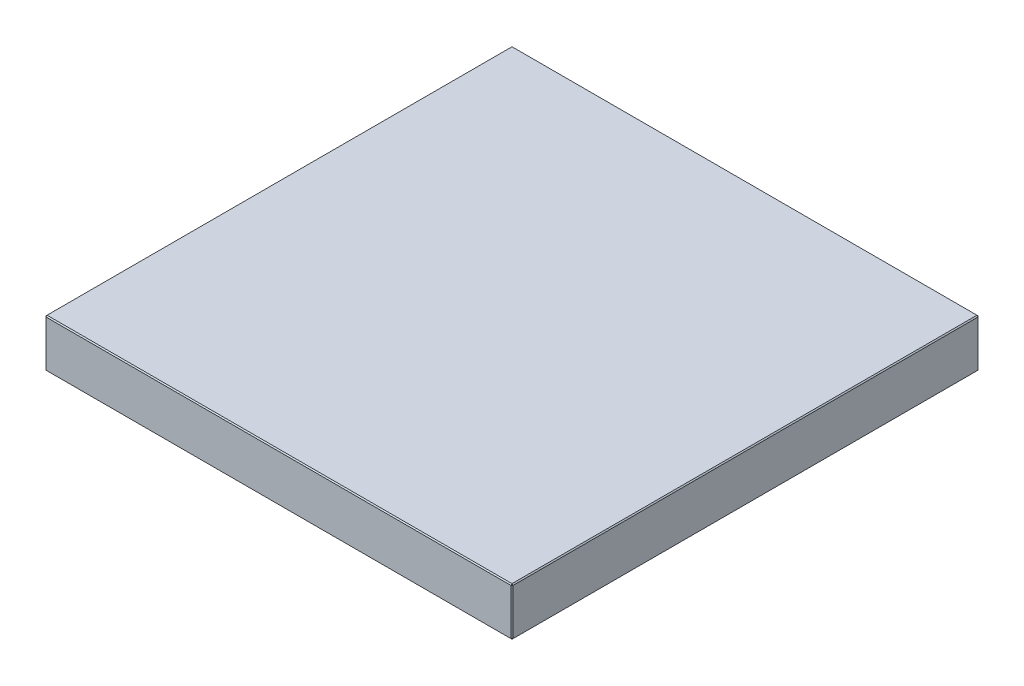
ISO-10303-21;
HEADER;
FILE_DESCRIPTION(('STEP AP214'),'2;1');
FILE_NAME('part.step','',(''),(''),'','','');
FILE_SCHEMA(('AUTOMOTIVE_DESIGN { 1 0 10303 214 1 1 1 1 }'));
ENDSEC;
DATA;
#1=APPLICATION_CONTEXT('core data for automotive mechanical design processes');
#2=APPLICATION_PROTOCOL_DEFINITION('international standard','automotive_design',2000,#1);
#3=PRODUCT_CONTEXT('',#1,'mechanical');
#4=PRODUCT('Part','Part','',(#3));
#5=PRODUCT_RELATED_PRODUCT_CATEGORY('part','',(#4));
#6=PRODUCT_DEFINITION_FORMATION('','',#4);
#7=PRODUCT_DEFINITION_CONTEXT('part definition',#1,'design');
#8=PRODUCT_DEFINITION('design','',#6,#7);
#9=PRODUCT_DEFINITION_SHAPE('','',#8);
#10=(LENGTH_UNIT() NAMED_UNIT(*) SI_UNIT(.MILLI.,.METRE.));
#11=(NAMED_UNIT(*) PLANE_ANGLE_UNIT() SI_UNIT($,.RADIAN.));
#12=(NAMED_UNIT(*) SI_UNIT($,.STERADIAN.) SOLID_ANGLE_UNIT());
#13=UNCERTAINTY_MEASURE_WITH_UNIT(LENGTH_MEASURE(1.E-05),#10,'distance_accuracy_value','');
#14=(GEOMETRIC_REPRESENTATION_CONTEXT(3) GLOBAL_UNCERTAINTY_ASSIGNED_CONTEXT((#13)) GLOBAL_UNIT_ASSIGNED_CONTEXT((#10,
#11,#12)) REPRESENTATION_CONTEXT('',''));
#15=CARTESIAN_POINT('',(0.,0.,0.));
#16=DIRECTION('',(0.,0.,1.));
#17=DIRECTION('',(1.,0.,0.));
#18=AXIS2_PLACEMENT_3D('',#15,#16,#17);
#19=CARTESIAN_POINT('',(-223.,46.,223.));
#20=DIRECTION('',(1.,0.,0.));
#21=DIRECTION('',(0.,0.,-1.));
#22=AXIS2_PLACEMENT_3D('',#19,#20,#21);
#23=PLANE('',#22);
#24=DIRECTION('',(0.,-1.,0.));
#25=VECTOR('',#24,1.);
#26=CARTESIAN_POINT('',(-223.,46.,-222.));
#27=LINE('',#26,#25);
#28=CARTESIAN_POINT('',(-223.,45.,-222.));
#29=VERTEX_POINT('',#28);
#30=CARTESIAN_POINT('',(-223.,1.,-222.));
#31=VERTEX_POINT('',#30);
#32=EDGE_CURVE('E114',#29,#31,#27,.T.);
#33=ORIENTED_EDGE('',*,*,#32,.T.);
#34=DIRECTION('',(0.,0.,1.));
#35=VECTOR('',#34,1.);
#36=CARTESIAN_POINT('',(-223.,1.,223.));
#37=LINE('',#36,#35);
#38=CARTESIAN_POINT('',(-223.,1.,222.));
#39=VERTEX_POINT('',#38);
#40=EDGE_CURVE('E110',#31,#39,#37,.T.);
#41=ORIENTED_EDGE('',*,*,#40,.T.);
#42=DIRECTION('',(0.,1.,0.));
#43=VECTOR('',#42,1.);
#44=CARTESIAN_POINT('',(-223.,46.,222.));
#45=LINE('',#44,#43);
#46=CARTESIAN_POINT('',(-223.,45.,222.));
#47=VERTEX_POINT('',#46);
#48=EDGE_CURVE('E103',#39,#47,#45,.T.);
#49=ORIENTED_EDGE('',*,*,#48,.T.);
#50=DIRECTION('',(0.,0.,-1.));
#51=VECTOR('',#50,1.);
#52=CARTESIAN_POINT('',(-223.,45.,-223.));
#53=LINE('',#52,#51);
#54=EDGE_CURVE('E107',#47,#29,#53,.T.);
#55=ORIENTED_EDGE('',*,*,#54,.T.);
#56=EDGE_LOOP('',(#33,#41,#49,#55));
#57=FACE_BOUND('',#56,.T.);
#58=ADVANCED_FACE('F15',(#57),#23,.F.);
#59=CARTESIAN_POINT('',(223.,46.,223.));
#60=DIRECTION('',(0.,0.,-1.));
#61=DIRECTION('',(-1.,0.,0.));
#62=AXIS2_PLACEMENT_3D('',#59,#60,#61);
#63=PLANE('',#62);
#64=DIRECTION('',(-1.,0.,0.));
#65=VECTOR('',#64,1.);
#66=CARTESIAN_POINT('',(-223.,45.,223.));
#67=LINE('',#66,#65);
#68=CARTESIAN_POINT('',(222.,45.,223.));
#69=VERTEX_POINT('',#68);
#70=CARTESIAN_POINT('',(-222.,45.,223.));
#71=VERTEX_POINT('',#70);
#72=EDGE_CURVE('E164',#69,#71,#67,.T.);
#73=ORIENTED_EDGE('',*,*,#72,.T.);
#74=DIRECTION('',(0.,-1.,0.));
#75=VECTOR('',#74,1.);
#76=CARTESIAN_POINT('',(-222.,46.,223.));
#77=LINE('',#76,#75);
#78=CARTESIAN_POINT('',(-222.,1.,223.));
#79=VERTEX_POINT('',#78);
#80=EDGE_CURVE('E122',#71,#79,#77,.T.);
#81=ORIENTED_EDGE('',*,*,#80,.T.);
#82=DIRECTION('',(1.,0.,0.));
#83=VECTOR('',#82,1.);
#84=CARTESIAN_POINT('',(223.,1.,223.));
#85=LINE('',#84,#83);
#86=CARTESIAN_POINT('',(222.,1.,223.));
#87=VERTEX_POINT('',#86);
#88=EDGE_CURVE('E168',#79,#87,#85,.T.);
#89=ORIENTED_EDGE('',*,*,#88,.T.);
#90=DIRECTION('',(0.,1.,0.));
#91=VECTOR('',#90,1.);
#92=CARTESIAN_POINT('',(222.,46.,223.));
#93=LINE('',#92,#91);
#94=EDGE_CURVE('E166',#87,#69,#93,.T.);
#95=ORIENTED_EDGE('',*,*,#94,.T.);
#96=EDGE_LOOP('',(#73,#81,#89,#95));
#97=FACE_BOUND('',#96,.T.);
#98=ADVANCED_FACE('F275',(#97),#63,.F.);
#99=CARTESIAN_POINT('',(223.,46.,223.));
#100=DIRECTION('',(-1.,0.,0.));
#101=DIRECTION('',(0.,0.,1.));
#102=AXIS2_PLACEMENT_3D('',#99,#100,#101);
#103=PLANE('',#102);
#104=DIRECTION('',(0.,0.,-1.));
#105=VECTOR('',#104,1.);
#106=CARTESIAN_POINT('',(223.,1.,223.));
#107=LINE('',#106,#105);
#108=CARTESIAN_POINT('',(223.,1.,222.));
#109=VERTEX_POINT('',#108);
#110=CARTESIAN_POINT('',(223.,1.,-222.));
#111=VERTEX_POINT('',#110);
#112=EDGE_CURVE('E159',#109,#111,#107,.T.);
#113=ORIENTED_EDGE('',*,*,#112,.T.);
#114=DIRECTION('',(0.,1.,0.));
#115=VECTOR('',#114,1.);
#116=CARTESIAN_POINT('',(223.,46.,-222.));
#117=LINE('',#116,#115);
#118=CARTESIAN_POINT('',(223.,45.,-222.));
#119=VERTEX_POINT('',#118);
#120=EDGE_CURVE('E161',#111,#119,#117,.T.);
#121=ORIENTED_EDGE('',*,*,#120,.T.);
#122=DIRECTION('',(0.,0.,1.));
#123=VECTOR('',#122,1.);
#124=CARTESIAN_POINT('',(223.,45.,223.));
#125=LINE('',#124,#123);
#126=CARTESIAN_POINT('',(223.,45.,222.));
#127=VERTEX_POINT('',#126);
#128=EDGE_CURVE('E155',#119,#127,#125,.T.);
#129=ORIENTED_EDGE('',*,*,#128,.T.);
#130=DIRECTION('',(0.,-1.,0.));
#131=VECTOR('',#130,1.);
#132=CARTESIAN_POINT('',(223.,46.,222.));
#133=LINE('',#132,#131);
#134=EDGE_CURVE('E157',#127,#109,#133,.T.);
#135=ORIENTED_EDGE('',*,*,#134,.T.);
#136=EDGE_LOOP('',(#113,#121,#129,#135));
#137=FACE_BOUND('',#136,.T.);
#138=ADVANCED_FACE('F254',(#137),#103,.F.);
#139=CARTESIAN_POINT('',(223.,46.,-223.));
#140=DIRECTION('',(0.,0.,1.));
#141=DIRECTION('',(1.,0.,0.));
#142=AXIS2_PLACEMENT_3D('',#139,#140,#141);
#143=PLANE('',#142);
#144=DIRECTION('',(0.,-1.,0.));
#145=VECTOR('',#144,1.);
#146=CARTESIAN_POINT('',(222.,46.,-223.));
#147=LINE('',#146,#145);
#148=CARTESIAN_POINT('',(222.,45.,-223.));
#149=VERTEX_POINT('',#148);
#150=CARTESIAN_POINT('',(222.,1.,-223.));
#151=VERTEX_POINT('',#150);
#152=EDGE_CURVE('E148',#149,#151,#147,.T.);
#153=ORIENTED_EDGE('',*,*,#152,.T.);
#154=DIRECTION('',(-1.,0.,0.));
#155=VECTOR('',#154,1.);
#156=CARTESIAN_POINT('',(223.,1.,-223.));
#157=LINE('',#156,#155);
#158=CARTESIAN_POINT('',(-222.,1.,-223.));
#159=VERTEX_POINT('',#158);
#160=EDGE_CURVE('E153',#151,#159,#157,.T.);
#161=ORIENTED_EDGE('',*,*,#160,.T.);
#162=DIRECTION('',(0.,1.,0.));
#163=VECTOR('',#162,1.);
#164=CARTESIAN_POINT('',(-222.,46.,-223.));
#165=LINE('',#164,#163);
#166=CARTESIAN_POINT('',(-222.,45.,-223.));
#167=VERTEX_POINT('',#166);
#168=EDGE_CURVE('E150',#159,#167,#165,.T.);
#169=ORIENTED_EDGE('',*,*,#168,.T.);
#170=DIRECTION('',(1.,0.,0.));
#171=VECTOR('',#170,1.);
#172=CARTESIAN_POINT('',(223.,45.,-223.));
#173=LINE('',#172,#171);
#174=EDGE_CURVE('E146',#167,#149,#173,.T.);
#175=ORIENTED_EDGE('',*,*,#174,.T.);
#176=EDGE_LOOP('',(#153,#161,#169,#175));
#177=FACE_BOUND('',#176,.T.);
#178=ADVANCED_FACE('F284',(#177),#143,.F.);
#179=CARTESIAN_POINT('',(0.,46.,0.));
#180=DIRECTION('',(0.,1.,0.));
#181=DIRECTION('',(0.,0.,1.));
#182=AXIS2_PLACEMENT_3D('',#179,#180,#181);
#183=PLANE('',#182);
#184=DIRECTION('',(0.,0.,-1.));
#185=VECTOR('',#184,1.);
#186=CARTESIAN_POINT('',(222.,46.,-223.));
#187=LINE('',#186,#185);
#188=CARTESIAN_POINT('',(222.,46.,222.));
#189=VERTEX_POINT('',#188);
#190=CARTESIAN_POINT('',(222.,46.,-222.));
#191=VERTEX_POINT('',#190);
#192=EDGE_CURVE('E24',#189,#191,#187,.T.);
#193=ORIENTED_EDGE('',*,*,#192,.T.);
#194=DIRECTION('',(-1.,0.,0.));
#195=VECTOR('',#194,1.);
#196=CARTESIAN_POINT('',(-223.,46.,-222.));
#197=LINE('',#196,#195);
#198=CARTESIAN_POINT('',(-222.,46.,-222.));
#199=VERTEX_POINT('',#198);
#200=EDGE_CURVE('E9',#191,#199,#197,.T.);
#201=ORIENTED_EDGE('',*,*,#200,.T.);
#202=DIRECTION('',(0.,0.,1.));
#203=VECTOR('',#202,1.);
#204=CARTESIAN_POINT('',(-222.,46.,223.));
#205=LINE('',#204,#203);
#206=CARTESIAN_POINT('',(-222.,46.,222.));
#207=VERTEX_POINT('',#206);
#208=EDGE_CURVE('E180',#199,#207,#205,.T.);
#209=ORIENTED_EDGE('',*,*,#208,.T.);
#210=DIRECTION('',(1.,0.,0.));
#211=VECTOR('',#210,1.);
#212=CARTESIAN_POINT('',(223.,46.,222.));
#213=LINE('',#212,#211);
#214=EDGE_CURVE('E35',#207,#189,#213,.T.);
#215=ORIENTED_EDGE('',*,*,#214,.T.);
#216=EDGE_LOOP('',(#193,#201,#209,#215));
#217=FACE_BOUND('',#216,.T.);
#218=ADVANCED_FACE('F350',(#217),#183,.T.);
#219=CARTESIAN_POINT('',(0.,0.,0.));
#220=DIRECTION('',(0.,1.,0.));
#221=DIRECTION('',(0.,0.,1.));
#222=AXIS2_PLACEMENT_3D('',#219,#220,#221);
#223=PLANE('',#222);
#224=DIRECTION('',(0.,0.,1.));
#225=VECTOR('',#224,1.);
#226=CARTESIAN_POINT('',(222.,0.,0.));
#227=LINE('',#226,#225);
#228=CARTESIAN_POINT('',(222.,0.,-222.));
#229=VERTEX_POINT('',#228);
#230=CARTESIAN_POINT('',(222.,0.,222.));
#231=VERTEX_POINT('',#230);
#232=EDGE_CURVE('E171',#229,#231,#227,.T.);
#233=ORIENTED_EDGE('',*,*,#232,.T.);
#234=DIRECTION('',(-1.,0.,0.));
#235=VECTOR('',#234,1.);
#236=CARTESIAN_POINT('',(0.,0.,222.));
#237=LINE('',#236,#235);
#238=CARTESIAN_POINT('',(-222.,0.,222.));
#239=VERTEX_POINT('',#238);
#240=EDGE_CURVE('E177',#231,#239,#237,.T.);
#241=ORIENTED_EDGE('',*,*,#240,.T.);
#242=DIRECTION('',(0.,0.,-1.));
#243=VECTOR('',#242,1.);
#244=CARTESIAN_POINT('',(-222.,0.,0.));
#245=LINE('',#244,#243);
#246=CARTESIAN_POINT('',(-222.,0.,-222.));
#247=VERTEX_POINT('',#246);
#248=EDGE_CURVE('E175',#239,#247,#245,.T.);
#249=ORIENTED_EDGE('',*,*,#248,.T.);
#250=DIRECTION('',(1.,0.,0.));
#251=VECTOR('',#250,1.);
#252=CARTESIAN_POINT('',(0.,0.,-222.));
#253=LINE('',#252,#251);
#254=EDGE_CURVE('E173',#247,#229,#253,.T.);
#255=ORIENTED_EDGE('',*,*,#254,.T.);
#256=EDGE_LOOP('',(#233,#241,#249,#255));
#257=FACE_BOUND('',#256,.T.);
#258=ADVANCED_FACE('F246',(#257),#223,.F.);
#259=CARTESIAN_POINT('',(223.,46.,222.));
#260=DIRECTION('',(-0.707106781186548,0.,-0.707106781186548));
#261=DIRECTION('',(0.,-1.,0.));
#262=AXIS2_PLACEMENT_3D('',#259,#260,#261);
#263=PLANE('',#262);
#264=DIRECTION('',(-0.707106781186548,0.,0.707106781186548));
#265=VECTOR('',#264,1.);
#266=CARTESIAN_POINT('',(222.,45.,223.));
#267=LINE('',#266,#265);
#268=EDGE_CURVE('E19',#69,#127,#267,.F.);
#269=ORIENTED_EDGE('',*,*,#268,.F.);
#270=ORIENTED_EDGE('',*,*,#94,.F.);
#271=DIRECTION('',(0.707106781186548,0.,-0.707106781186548));
#272=VECTOR('',#271,1.);
#273=CARTESIAN_POINT('',(222.,1.,223.));
#274=LINE('',#273,#272);
#275=EDGE_CURVE('E142',#109,#87,#274,.F.);
#276=ORIENTED_EDGE('',*,*,#275,.F.);
#277=ORIENTED_EDGE('',*,*,#134,.F.);
#278=EDGE_LOOP('',(#269,#270,#276,#277));
#279=FACE_BOUND('',#278,.T.);
#280=ADVANCED_FACE('F17',(#279),#263,.F.);
#281=CARTESIAN_POINT('',(222.,45.,223.));
#282=DIRECTION('',(0.577350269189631,0.577350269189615,0.577350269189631));
#283=DIRECTION('',(0.707106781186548,0.,-0.707106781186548));
#284=AXIS2_PLACEMENT_3D('',#281,#282,#283);
#285=PLANE('',#284);
#286=DIRECTION('',(0.,-0.707106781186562,0.707106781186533));
#287=VECTOR('',#286,1.);
#288=CARTESIAN_POINT('',(222.,45.,223.));
#289=LINE('',#288,#287);
#290=EDGE_CURVE('E226',#69,#189,#289,.F.);
#291=ORIENTED_EDGE('',*,*,#290,.F.);
#292=ORIENTED_EDGE('',*,*,#268,.T.);
#293=DIRECTION('',(-0.707106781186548,0.707106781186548,0.));
#294=VECTOR('',#293,1.);
#295=CARTESIAN_POINT('',(222.5,45.5,222.));
#296=LINE('',#295,#294);
#297=EDGE_CURVE('E228',#189,#127,#296,.F.);
#298=ORIENTED_EDGE('',*,*,#297,.F.);
#299=EDGE_LOOP('',(#291,#292,#298));
#300=FACE_BOUND('',#299,.T.);
#301=ADVANCED_FACE('F270',(#300),#285,.T.);
#302=CARTESIAN_POINT('',(222.,1.,223.));
#303=DIRECTION('',(0.577350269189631,-0.577350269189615,0.577350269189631));
#304=DIRECTION('',(0.707106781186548,0.,-0.707106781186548));
#305=AXIS2_PLACEMENT_3D('',#302,#303,#304);
#306=PLANE('',#305);
#307=DIRECTION('',(-0.707106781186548,-0.707106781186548,0.));
#308=VECTOR('',#307,1.);
#309=CARTESIAN_POINT('',(222.5,0.499999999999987,222.));
#310=LINE('',#309,#308);
#311=EDGE_CURVE('E220',#109,#231,#310,.T.);
#312=ORIENTED_EDGE('',*,*,#311,.F.);
#313=ORIENTED_EDGE('',*,*,#275,.T.);
#314=DIRECTION('',(0.,0.707106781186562,0.707106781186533));
#315=VECTOR('',#314,1.);
#316=CARTESIAN_POINT('',(222.,1.,223.));
#317=LINE('',#316,#315);
#318=EDGE_CURVE('E223',#231,#87,#317,.T.);
#319=ORIENTED_EDGE('',*,*,#318,.F.);
#320=EDGE_LOOP('',(#312,#313,#319));
#321=FACE_BOUND('',#320,.T.);
#322=ADVANCED_FACE('F235',(#321),#306,.T.);
#323=CARTESIAN_POINT('',(222.,46.,0.));
#324=DIRECTION('',(0.707106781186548,0.707106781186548,0.));
#325=DIRECTION('',(0.,0.,1.));
#326=AXIS2_PLACEMENT_3D('',#323,#324,#325);
#327=PLANE('',#326);
#328=ORIENTED_EDGE('',*,*,#297,.T.);
#329=ORIENTED_EDGE('',*,*,#128,.F.);
#330=DIRECTION('',(0.707106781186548,-0.707106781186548,0.));
#331=VECTOR('',#330,1.);
#332=CARTESIAN_POINT('',(223.,45.,-222.));
#333=LINE('',#332,#331);
#334=EDGE_CURVE('E215',#191,#119,#333,.T.);
#335=ORIENTED_EDGE('',*,*,#334,.F.);
#336=ORIENTED_EDGE('',*,*,#192,.F.);
#337=EDGE_LOOP('',(#328,#329,#335,#336));
#338=FACE_BOUND('',#337,.T.);
#339=ADVANCED_FACE('F265',(#338),#327,.T.);
#340=CARTESIAN_POINT('',(0.,46.,222.));
#341=DIRECTION('',(0.,0.707106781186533,0.707106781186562));
#342=DIRECTION('',(-1.,0.,0.));
#343=AXIS2_PLACEMENT_3D('',#340,#341,#342);
#344=PLANE('',#343);
#345=ORIENTED_EDGE('',*,*,#290,.T.);
#346=ORIENTED_EDGE('',*,*,#214,.F.);
#347=DIRECTION('',(0.,0.707106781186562,-0.707106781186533));
#348=VECTOR('',#347,1.);
#349=CARTESIAN_POINT('',(-222.,45.5,222.5));
#350=LINE('',#349,#348);
#351=EDGE_CURVE('E126',#71,#207,#350,.T.);
#352=ORIENTED_EDGE('',*,*,#351,.F.);
#353=ORIENTED_EDGE('',*,*,#72,.F.);
#354=EDGE_LOOP('',(#345,#346,#352,#353));
#355=FACE_BOUND('',#354,.T.);
#356=ADVANCED_FACE('F273',(#355),#344,.T.);
#357=CARTESIAN_POINT('',(-222.,46.,223.));
#358=DIRECTION('',(0.707106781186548,0.,-0.707106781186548));
#359=DIRECTION('',(0.,-1.,0.));
#360=AXIS2_PLACEMENT_3D('',#357,#358,#359);
#361=PLANE('',#360);
#362=DIRECTION('',(0.707106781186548,0.,0.707106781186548));
#363=VECTOR('',#362,1.);
#364=CARTESIAN_POINT('',(-222.,1.,223.));
#365=LINE('',#364,#363);
#366=EDGE_CURVE('E127',#79,#39,#365,.F.);
#367=ORIENTED_EDGE('',*,*,#366,.F.);
#368=ORIENTED_EDGE('',*,*,#80,.F.);
#369=DIRECTION('',(-0.707106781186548,0.,-0.707106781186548));
#370=VECTOR('',#369,1.);
#371=CARTESIAN_POINT('',(-223.,45.,222.));
#372=LINE('',#371,#370);
#373=EDGE_CURVE('E118',#47,#71,#372,.F.);
#374=ORIENTED_EDGE('',*,*,#373,.F.);
#375=ORIENTED_EDGE('',*,*,#48,.F.);
#376=EDGE_LOOP('',(#367,#368,#374,#375));
#377=FACE_BOUND('',#376,.T.);
#378=ADVANCED_FACE('F120',(#377),#361,.F.);
#379=CARTESIAN_POINT('',(223.,1.,223.));
#380=DIRECTION('',(0.,0.707106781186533,-0.707106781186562));
#381=DIRECTION('',(1.,0.,0.));
#382=AXIS2_PLACEMENT_3D('',#379,#380,#381);
#383=PLANE('',#382);
#384=ORIENTED_EDGE('',*,*,#318,.T.);
#385=ORIENTED_EDGE('',*,*,#88,.F.);
#386=DIRECTION('',(0.,-0.707106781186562,-0.707106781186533));
#387=VECTOR('',#386,1.);
#388=CARTESIAN_POINT('',(-222.,1.,223.));
#389=LINE('',#388,#387);
#390=EDGE_CURVE('E211',#239,#79,#389,.F.);
#391=ORIENTED_EDGE('',*,*,#390,.F.);
#392=ORIENTED_EDGE('',*,*,#240,.F.);
#393=EDGE_LOOP('',(#384,#385,#391,#392));
#394=FACE_BOUND('',#393,.T.);
#395=ADVANCED_FACE('F243',(#394),#383,.F.);
#396=CARTESIAN_POINT('',(223.,1.,223.));
#397=DIRECTION('',(-0.707106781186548,0.707106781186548,0.));
#398=DIRECTION('',(0.,0.,-1.));
#399=AXIS2_PLACEMENT_3D('',#396,#397,#398);
#400=PLANE('',#399);
#401=ORIENTED_EDGE('',*,*,#311,.T.);
#402=ORIENTED_EDGE('',*,*,#232,.F.);
#403=DIRECTION('',(0.707106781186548,0.707106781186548,0.));
#404=VECTOR('',#403,1.);
#405=CARTESIAN_POINT('',(222.5,0.499999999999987,-222.));
#406=LINE('',#405,#404);
#407=EDGE_CURVE('E208',#111,#229,#406,.F.);
#408=ORIENTED_EDGE('',*,*,#407,.F.);
#409=ORIENTED_EDGE('',*,*,#112,.F.);
#410=EDGE_LOOP('',(#401,#402,#408,#409));
#411=FACE_BOUND('',#410,.T.);
#412=ADVANCED_FACE('F251',(#411),#400,.F.);
#413=CARTESIAN_POINT('',(222.,46.,-223.));
#414=DIRECTION('',(-0.707106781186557,0.,0.707106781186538));
#415=DIRECTION('',(0.,-1.,0.));
#416=AXIS2_PLACEMENT_3D('',#413,#414,#415);
#417=PLANE('',#416);
#418=DIRECTION('',(0.707106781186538,0.,0.707106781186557));
#419=VECTOR('',#418,1.);
#420=CARTESIAN_POINT('',(223.,45.,-222.));
#421=LINE('',#420,#419);
#422=EDGE_CURVE('E217',#119,#149,#421,.F.);
#423=ORIENTED_EDGE('',*,*,#422,.F.);
#424=ORIENTED_EDGE('',*,*,#120,.F.);
#425=DIRECTION('',(-0.707106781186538,0.,-0.707106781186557));
#426=VECTOR('',#425,1.);
#427=CARTESIAN_POINT('',(222.,1.,-223.));
#428=LINE('',#427,#426);
#429=EDGE_CURVE('E205',#151,#111,#428,.F.);
#430=ORIENTED_EDGE('',*,*,#429,.F.);
#431=ORIENTED_EDGE('',*,*,#152,.F.);
#432=EDGE_LOOP('',(#423,#424,#430,#431));
#433=FACE_BOUND('',#432,.T.);
#434=ADVANCED_FACE('F258',(#433),#417,.F.);
#435=CARTESIAN_POINT('',(223.,45.,-222.));
#436=DIRECTION('',(0.577350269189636,0.57735026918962,-0.57735026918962));
#437=DIRECTION('',(-0.707106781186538,0.,-0.707106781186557));
#438=AXIS2_PLACEMENT_3D('',#435,#436,#437);
#439=PLANE('',#438);
#440=ORIENTED_EDGE('',*,*,#334,.T.);
#441=ORIENTED_EDGE('',*,*,#422,.T.);
#442=DIRECTION('',(0.,0.707106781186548,0.707106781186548));
#443=VECTOR('',#442,1.);
#444=CARTESIAN_POINT('',(222.,45.5,-222.5));
#445=LINE('',#444,#443);
#446=EDGE_CURVE('E134',#191,#149,#445,.F.);
#447=ORIENTED_EDGE('',*,*,#446,.F.);
#448=EDGE_LOOP('',(#440,#441,#447));
#449=FACE_BOUND('',#448,.T.);
#450=ADVANCED_FACE('F325',(#449),#439,.T.);
#451=CARTESIAN_POINT('',(-223.,45.,222.));
#452=DIRECTION('',(-0.577350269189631,0.577350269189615,0.577350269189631));
#453=DIRECTION('',(0.707106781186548,0.,0.707106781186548));
#454=AXIS2_PLACEMENT_3D('',#451,#452,#453);
#455=PLANE('',#454);
#456=ORIENTED_EDGE('',*,*,#373,.T.);
#457=ORIENTED_EDGE('',*,*,#351,.T.);
#458=DIRECTION('',(-0.707106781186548,-0.707106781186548,0.));
#459=VECTOR('',#458,1.);
#460=CARTESIAN_POINT('',(-223.,45.,222.));
#461=LINE('',#460,#459);
#462=EDGE_CURVE('E130',#47,#207,#461,.F.);
#463=ORIENTED_EDGE('',*,*,#462,.F.);
#464=EDGE_LOOP('',(#456,#457,#463));
#465=FACE_BOUND('',#464,.T.);
#466=ADVANCED_FACE('F131',(#465),#455,.T.);
#467=CARTESIAN_POINT('',(-222.,1.,223.));
#468=DIRECTION('',(-0.577350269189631,-0.577350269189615,0.577350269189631));
#469=DIRECTION('',(0.707106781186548,0.,0.707106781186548));
#470=AXIS2_PLACEMENT_3D('',#467,#468,#469);
#471=PLANE('',#470);
#472=ORIENTED_EDGE('',*,*,#390,.T.);
#473=ORIENTED_EDGE('',*,*,#366,.T.);
#474=DIRECTION('',(-0.707106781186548,0.707106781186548,0.));
#475=VECTOR('',#474,1.);
#476=CARTESIAN_POINT('',(-222.5,0.499999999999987,222.));
#477=LINE('',#476,#475);
#478=EDGE_CURVE('E135',#239,#39,#477,.T.);
#479=ORIENTED_EDGE('',*,*,#478,.F.);
#480=EDGE_LOOP('',(#472,#473,#479));
#481=FACE_BOUND('',#480,.T.);
#482=ADVANCED_FACE('F318',(#481),#471,.T.);
#483=CARTESIAN_POINT('',(222.,1.,-223.));
#484=DIRECTION('',(0.577350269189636,-0.57735026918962,-0.57735026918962));
#485=DIRECTION('',(-0.707106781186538,0.,-0.707106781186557));
#486=AXIS2_PLACEMENT_3D('',#483,#484,#485);
#487=PLANE('',#486);
#488=ORIENTED_EDGE('',*,*,#429,.T.);
#489=ORIENTED_EDGE('',*,*,#407,.T.);
#490=DIRECTION('',(0.,-0.707106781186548,0.707106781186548));
#491=VECTOR('',#490,1.);
#492=CARTESIAN_POINT('',(222.,1.,-223.));
#493=LINE('',#492,#491);
#494=EDGE_CURVE('E198',#151,#229,#493,.T.);
#495=ORIENTED_EDGE('',*,*,#494,.F.);
#496=EDGE_LOOP('',(#488,#489,#495));
#497=FACE_BOUND('',#496,.T.);
#498=ADVANCED_FACE('F314',(#497),#487,.T.);
#499=CARTESIAN_POINT('',(0.,46.,-222.));
#500=DIRECTION('',(0.,0.707106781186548,-0.707106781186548));
#501=DIRECTION('',(1.,0.,0.));
#502=AXIS2_PLACEMENT_3D('',#499,#500,#501);
#503=PLANE('',#502);
#504=ORIENTED_EDGE('',*,*,#446,.T.);
#505=ORIENTED_EDGE('',*,*,#174,.F.);
#506=DIRECTION('',(0.,-0.707106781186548,-0.707106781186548));
#507=VECTOR('',#506,1.);
#508=CARTESIAN_POINT('',(-222.,45.,-223.));
#509=LINE('',#508,#507);
#510=EDGE_CURVE('E195',#199,#167,#509,.T.);
#511=ORIENTED_EDGE('',*,*,#510,.F.);
#512=ORIENTED_EDGE('',*,*,#200,.F.);
#513=EDGE_LOOP('',(#504,#505,#511,#512));
#514=FACE_BOUND('',#513,.T.);
#515=ADVANCED_FACE('F311',(#514),#503,.T.);
#516=CARTESIAN_POINT('',(-222.,46.,0.));
#517=DIRECTION('',(-0.707106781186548,0.707106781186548,0.));
#518=DIRECTION('',(0.,0.,-1.));
#519=AXIS2_PLACEMENT_3D('',#516,#517,#518);
#520=PLANE('',#519);
#521=ORIENTED_EDGE('',*,*,#462,.T.);
#522=ORIENTED_EDGE('',*,*,#208,.F.);
#523=DIRECTION('',(0.707106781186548,0.707106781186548,0.));
#524=VECTOR('',#523,1.);
#525=CARTESIAN_POINT('',(-222.5,45.5,-222.));
#526=LINE('',#525,#524);
#527=EDGE_CURVE('E138',#29,#199,#526,.T.);
#528=ORIENTED_EDGE('',*,*,#527,.F.);
#529=ORIENTED_EDGE('',*,*,#54,.F.);
#530=EDGE_LOOP('',(#521,#522,#528,#529));
#531=FACE_BOUND('',#530,.T.);
#532=ADVANCED_FACE('F137',(#531),#520,.T.);
#533=CARTESIAN_POINT('',(-223.,1.,223.));
#534=DIRECTION('',(0.707106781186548,0.707106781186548,0.));
#535=DIRECTION('',(0.,0.,1.));
#536=AXIS2_PLACEMENT_3D('',#533,#534,#535);
#537=PLANE('',#536);
#538=ORIENTED_EDGE('',*,*,#478,.T.);
#539=ORIENTED_EDGE('',*,*,#40,.F.);
#540=DIRECTION('',(0.707106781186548,-0.707106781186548,0.));
#541=VECTOR('',#540,1.);
#542=CARTESIAN_POINT('',(-223.,1.,-222.));
#543=LINE('',#542,#541);
#544=EDGE_CURVE('E191',#247,#31,#543,.F.);
#545=ORIENTED_EDGE('',*,*,#544,.F.);
#546=ORIENTED_EDGE('',*,*,#248,.F.);
#547=EDGE_LOOP('',(#538,#539,#545,#546));
#548=FACE_BOUND('',#547,.T.);
#549=ADVANCED_FACE('F304',(#548),#537,.F.);
#550=CARTESIAN_POINT('',(223.,1.,-223.));
#551=DIRECTION('',(0.,0.707106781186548,0.707106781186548));
#552=DIRECTION('',(-1.,0.,0.));
#553=AXIS2_PLACEMENT_3D('',#550,#551,#552);
#554=PLANE('',#553);
#555=ORIENTED_EDGE('',*,*,#494,.T.);
#556=ORIENTED_EDGE('',*,*,#254,.F.);
#557=DIRECTION('',(0.,0.707106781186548,-0.707106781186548));
#558=VECTOR('',#557,1.);
#559=CARTESIAN_POINT('',(-222.,0.5,-222.5));
#560=LINE('',#559,#558);
#561=EDGE_CURVE('E188',#159,#247,#560,.F.);
#562=ORIENTED_EDGE('',*,*,#561,.F.);
#563=ORIENTED_EDGE('',*,*,#160,.F.);
#564=EDGE_LOOP('',(#555,#556,#562,#563));
#565=FACE_BOUND('',#564,.T.);
#566=ADVANCED_FACE('F300',(#565),#554,.F.);
#567=CARTESIAN_POINT('',(-222.,45.,-223.));
#568=DIRECTION('',(-0.577350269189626,0.577350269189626,-0.577350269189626));
#569=DIRECTION('',(-0.707106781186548,0.,0.707106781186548));
#570=AXIS2_PLACEMENT_3D('',#567,#568,#569);
#571=PLANE('',#570);
#572=ORIENTED_EDGE('',*,*,#527,.T.);
#573=ORIENTED_EDGE('',*,*,#510,.T.);
#574=DIRECTION('',(0.707106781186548,0.,-0.707106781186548));
#575=VECTOR('',#574,1.);
#576=CARTESIAN_POINT('',(-222.,45.,-223.));
#577=LINE('',#576,#575);
#578=EDGE_CURVE('E186',#29,#167,#577,.T.);
#579=ORIENTED_EDGE('',*,*,#578,.F.);
#580=EDGE_LOOP('',(#572,#573,#579));
#581=FACE_BOUND('',#580,.T.);
#582=ADVANCED_FACE('F296',(#581),#571,.T.);
#583=CARTESIAN_POINT('',(-223.,1.,-222.));
#584=DIRECTION('',(-0.577350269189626,-0.577350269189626,-0.577350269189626));
#585=DIRECTION('',(-0.707106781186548,0.,0.707106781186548));
#586=AXIS2_PLACEMENT_3D('',#583,#584,#585);
#587=PLANE('',#586);
#588=ORIENTED_EDGE('',*,*,#561,.T.);
#589=ORIENTED_EDGE('',*,*,#544,.T.);
#590=DIRECTION('',(-0.707106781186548,0.,0.707106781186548));
#591=VECTOR('',#590,1.);
#592=CARTESIAN_POINT('',(-223.,1.,-222.));
#593=LINE('',#592,#591);
#594=EDGE_CURVE('E184',#159,#31,#593,.T.);
#595=ORIENTED_EDGE('',*,*,#594,.F.);
#596=EDGE_LOOP('',(#588,#589,#595));
#597=FACE_BOUND('',#596,.T.);
#598=ADVANCED_FACE('F292',(#597),#587,.T.);
#599=CARTESIAN_POINT('',(-223.,46.,-222.));
#600=DIRECTION('',(0.707106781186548,0.,0.707106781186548));
#601=DIRECTION('',(0.,-1.,0.));
#602=AXIS2_PLACEMENT_3D('',#599,#600,#601);
#603=PLANE('',#602);
#604=ORIENTED_EDGE('',*,*,#578,.T.);
#605=ORIENTED_EDGE('',*,*,#168,.F.);
#606=ORIENTED_EDGE('',*,*,#594,.T.);
#607=ORIENTED_EDGE('',*,*,#32,.F.);
#608=EDGE_LOOP('',(#604,#605,#606,#607));
#609=FACE_BOUND('',#608,.T.);
#610=ADVANCED_FACE('F289',(#609),#603,.F.);
#611=CLOSED_SHELL('',(#58,#98,#138,#178,#218,#258,#280,#301,#322,#339,#356,#378,#395,#412,#434,
#450,#466,#482,#498,#515,#532,#549,#566,#582,#598,#610));
#612=MANIFOLD_SOLID_BREP('B1',#611);
#613=ADVANCED_BREP_SHAPE_REPRESENTATION('',(#18,#612),#14);
#614=SHAPE_DEFINITION_REPRESENTATION(#9,#613);
ENDSEC;
END-ISO-10303-21;
